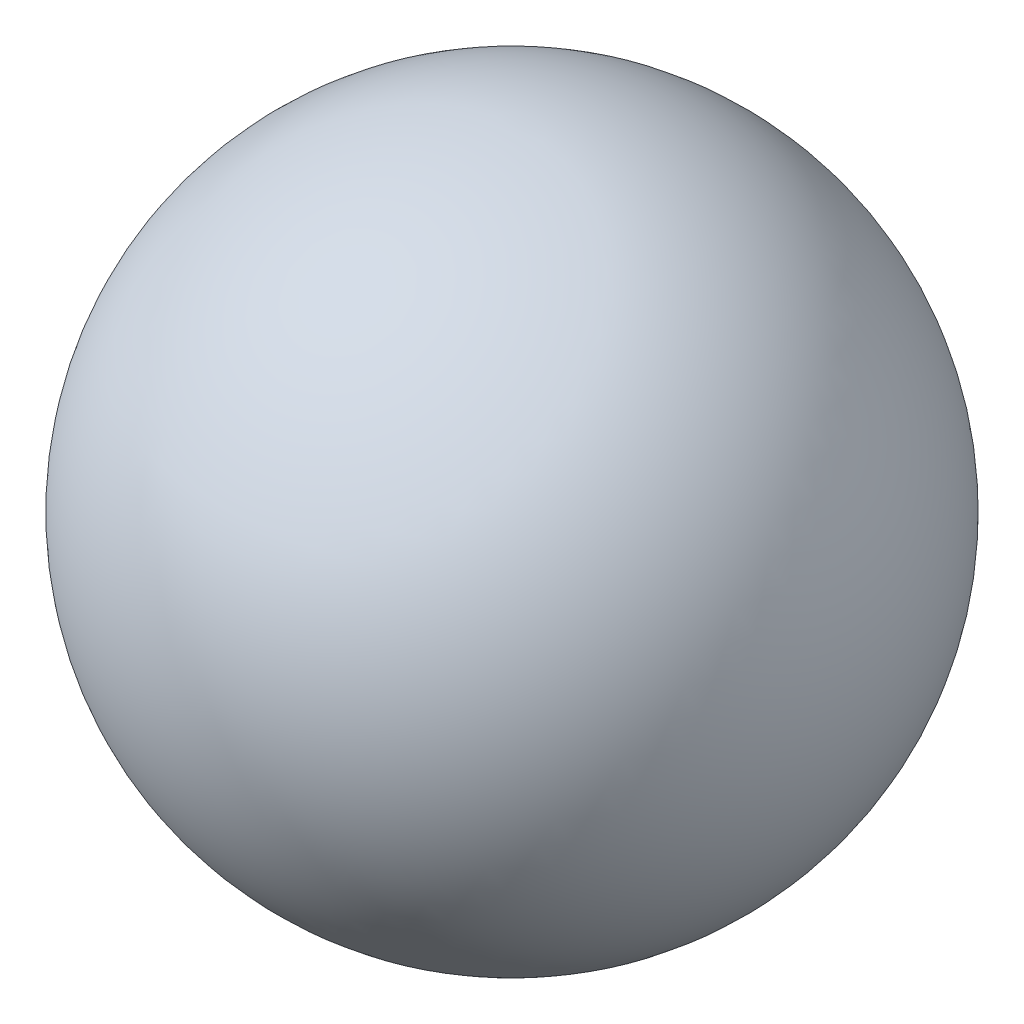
ISO-10303-21;
HEADER;
FILE_DESCRIPTION(('STEP AP214'),'2;1');
FILE_NAME('part.step','',(''),(''),'','','');
FILE_SCHEMA(('AUTOMOTIVE_DESIGN { 1 0 10303 214 1 1 1 1 }'));
ENDSEC;
DATA;
#1=APPLICATION_CONTEXT('core data for automotive mechanical design processes');
#2=APPLICATION_PROTOCOL_DEFINITION('international standard','automotive_design',2000,#1);
#3=PRODUCT_CONTEXT('',#1,'mechanical');
#4=PRODUCT('Part','Part','',(#3));
#5=PRODUCT_RELATED_PRODUCT_CATEGORY('part','',(#4));
#6=PRODUCT_DEFINITION_FORMATION('','',#4);
#7=PRODUCT_DEFINITION_CONTEXT('part definition',#1,'design');
#8=PRODUCT_DEFINITION('design','',#6,#7);
#9=PRODUCT_DEFINITION_SHAPE('','',#8);
#10=(LENGTH_UNIT() NAMED_UNIT(*) SI_UNIT(.MILLI.,.METRE.));
#11=(NAMED_UNIT(*) PLANE_ANGLE_UNIT() SI_UNIT($,.RADIAN.));
#12=(NAMED_UNIT(*) SI_UNIT($,.STERADIAN.) SOLID_ANGLE_UNIT());
#13=UNCERTAINTY_MEASURE_WITH_UNIT(LENGTH_MEASURE(1.E-05),#10,'distance_accuracy_value','');
#14=(GEOMETRIC_REPRESENTATION_CONTEXT(3) GLOBAL_UNCERTAINTY_ASSIGNED_CONTEXT((#13)) GLOBAL_UNIT_ASSIGNED_CONTEXT((#10,
#11,#12)) REPRESENTATION_CONTEXT('',''));
#15=CARTESIAN_POINT('',(0.,0.,0.));
#16=DIRECTION('',(0.,0.,1.));
#17=DIRECTION('',(1.,0.,0.));
#18=AXIS2_PLACEMENT_3D('',#15,#16,#17);
#19=CARTESIAN_POINT('',(0.,0.,0.));
#20=DIRECTION('',(0.,-1.,0.));
#21=DIRECTION('',(-1.,0.,0.));
#22=AXIS2_PLACEMENT_3D('',#19,#20,#21);
#23=SPHERICAL_SURFACE('',#22,2.9845);
#24=CARTESIAN_POINT('',(0.,-2.9845,0.));
#25=VERTEX_POINT('',#24);
#26=VERTEX_LOOP('',#25);
#27=FACE_BOUND('',#26,.T.);
#28=ADVANCED_FACE('F27',(#27),#23,.T.);
#29=CLOSED_SHELL('',(#28));
#30=MANIFOLD_SOLID_BREP('B2',#29);
#31=ADVANCED_BREP_SHAPE_REPRESENTATION('',(#18,#30),#14);
#32=SHAPE_DEFINITION_REPRESENTATION(#9,#31);
ENDSEC;
END-ISO-10303-21;
